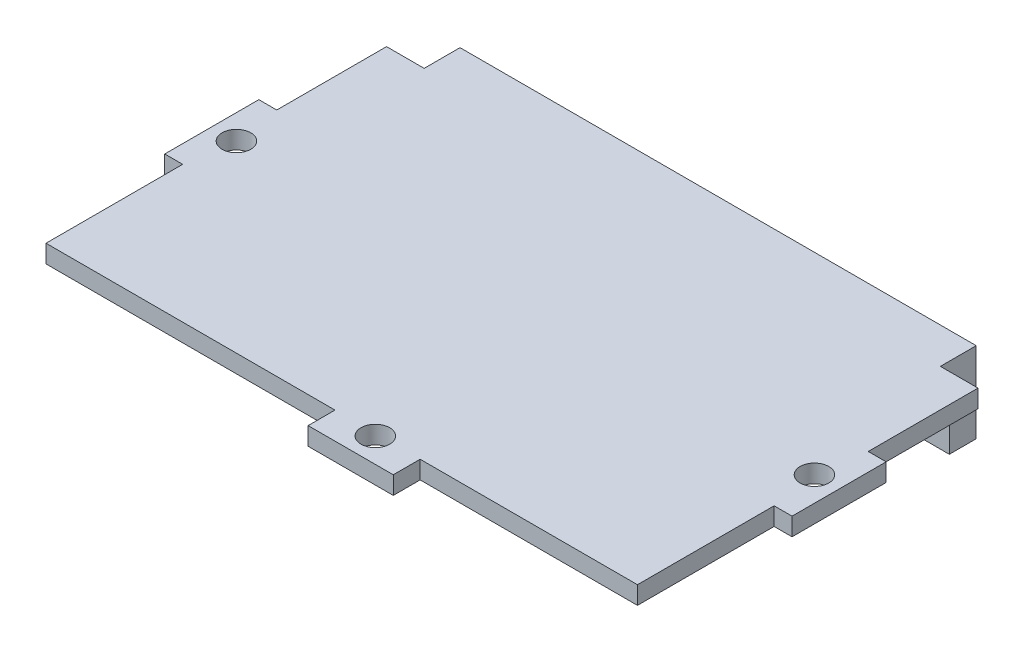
ISO-10303-21;
HEADER;
FILE_DESCRIPTION(('STEP AP214'),'2;1');
FILE_NAME('part.step','',(''),(''),'','','');
FILE_SCHEMA(('AUTOMOTIVE_DESIGN { 1 0 10303 214 1 1 1 1 }'));
ENDSEC;
DATA;
#1=APPLICATION_CONTEXT('core data for automotive mechanical design processes');
#2=APPLICATION_PROTOCOL_DEFINITION('international standard','automotive_design',2000,#1);
#3=PRODUCT_CONTEXT('',#1,'mechanical');
#4=PRODUCT('Part','Part','',(#3));
#5=PRODUCT_RELATED_PRODUCT_CATEGORY('part','',(#4));
#6=PRODUCT_DEFINITION_FORMATION('','',#4);
#7=PRODUCT_DEFINITION_CONTEXT('part definition',#1,'design');
#8=PRODUCT_DEFINITION('design','',#6,#7);
#9=PRODUCT_DEFINITION_SHAPE('','',#8);
#10=(LENGTH_UNIT() NAMED_UNIT(*) SI_UNIT(.MILLI.,.METRE.));
#11=(NAMED_UNIT(*) PLANE_ANGLE_UNIT() SI_UNIT($,.RADIAN.));
#12=(NAMED_UNIT(*) SI_UNIT($,.STERADIAN.) SOLID_ANGLE_UNIT());
#13=UNCERTAINTY_MEASURE_WITH_UNIT(LENGTH_MEASURE(1.E-05),#10,'distance_accuracy_value','');
#14=(GEOMETRIC_REPRESENTATION_CONTEXT(3) GLOBAL_UNCERTAINTY_ASSIGNED_CONTEXT((#13)) GLOBAL_UNIT_ASSIGNED_CONTEXT((#10,
#11,#12)) REPRESENTATION_CONTEXT('',''));
#15=CARTESIAN_POINT('',(0.,0.,0.));
#16=DIRECTION('',(0.,0.,1.));
#17=DIRECTION('',(1.,0.,0.));
#18=AXIS2_PLACEMENT_3D('',#15,#16,#17);
#19=CARTESIAN_POINT('',(33.,2.,21.));
#20=DIRECTION('',(0.,0.,-1.));
#21=DIRECTION('',(-1.,0.,0.));
#22=AXIS2_PLACEMENT_3D('',#19,#20,#21);
#23=PLANE('',#22);
#24=DIRECTION('',(1.,0.,0.));
#25=VECTOR('',#24,1.);
#26=CARTESIAN_POINT('',(33.,2.,21.));
#27=LINE('',#26,#25);
#28=CARTESIAN_POINT('',(8.75000000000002,2.,21.));
#29=VERTEX_POINT('',#28);
#30=CARTESIAN_POINT('',(33.,2.,21.));
#31=VERTEX_POINT('',#30);
#32=EDGE_CURVE('E343',#29,#31,#27,.T.);
#33=ORIENTED_EDGE('',*,*,#32,.F.);
#34=DIRECTION('',(0.,-1.,0.));
#35=VECTOR('',#34,1.);
#36=CARTESIAN_POINT('',(8.75000000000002,2.,21.));
#37=LINE('',#36,#35);
#38=CARTESIAN_POINT('',(8.75000000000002,0.,21.));
#39=VERTEX_POINT('',#38);
#40=EDGE_CURVE('E189',#29,#39,#37,.T.);
#41=ORIENTED_EDGE('',*,*,#40,.T.);
#42=DIRECTION('',(1.,0.,0.));
#43=VECTOR('',#42,1.);
#44=CARTESIAN_POINT('',(33.,0.,21.));
#45=LINE('',#44,#43);
#46=CARTESIAN_POINT('',(33.,0.,21.));
#47=VERTEX_POINT('',#46);
#48=EDGE_CURVE('E357',#39,#47,#45,.T.);
#49=ORIENTED_EDGE('',*,*,#48,.T.);
#50=DIRECTION('',(0.,-1.,0.));
#51=VECTOR('',#50,1.);
#52=CARTESIAN_POINT('',(33.,2.,21.));
#53=LINE('',#52,#51);
#54=EDGE_CURVE('E45',#31,#47,#53,.T.);
#55=ORIENTED_EDGE('',*,*,#54,.F.);
#56=EDGE_LOOP('',(#33,#41,#49,#55));
#57=FACE_BOUND('',#56,.T.);
#58=ADVANCED_FACE('F37',(#57),#23,.F.);
#59=CARTESIAN_POINT('',(-33.,2.,21.));
#60=DIRECTION('',(1.,0.,0.));
#61=DIRECTION('',(0.,0.,-1.));
#62=AXIS2_PLACEMENT_3D('',#59,#60,#61);
#63=PLANE('',#62);
#64=DIRECTION('',(0.,0.,1.));
#65=VECTOR('',#64,1.);
#66=CARTESIAN_POINT('',(-33.,2.,21.));
#67=LINE('',#66,#65);
#68=CARTESIAN_POINT('',(-33.,2.,5.74999999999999));
#69=VERTEX_POINT('',#68);
#70=CARTESIAN_POINT('',(-33.,2.,21.));
#71=VERTEX_POINT('',#70);
#72=EDGE_CURVE('E344',#69,#71,#67,.T.);
#73=ORIENTED_EDGE('',*,*,#72,.F.);
#74=DIRECTION('',(0.,-1.,0.));
#75=VECTOR('',#74,1.);
#76=CARTESIAN_POINT('',(-33.,2.,5.74999999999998));
#77=LINE('',#76,#75);
#78=CARTESIAN_POINT('',(-33.,0.,5.74999999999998));
#79=VERTEX_POINT('',#78);
#80=EDGE_CURVE('E274',#69,#79,#77,.T.);
#81=ORIENTED_EDGE('',*,*,#80,.T.);
#82=DIRECTION('',(0.,0.,1.));
#83=VECTOR('',#82,1.);
#84=CARTESIAN_POINT('',(-33.,0.,21.));
#85=LINE('',#84,#83);
#86=CARTESIAN_POINT('',(-33.,0.,21.));
#87=VERTEX_POINT('',#86);
#88=EDGE_CURVE('E320',#79,#87,#85,.T.);
#89=ORIENTED_EDGE('',*,*,#88,.T.);
#90=DIRECTION('',(0.,-1.,0.));
#91=VECTOR('',#90,1.);
#92=CARTESIAN_POINT('',(-33.,2.,21.));
#93=LINE('',#92,#91);
#94=EDGE_CURVE('E11',#71,#87,#93,.T.);
#95=ORIENTED_EDGE('',*,*,#94,.F.);
#96=EDGE_LOOP('',(#73,#81,#89,#95));
#97=FACE_BOUND('',#96,.T.);
#98=ADVANCED_FACE('F381',(#97),#63,.F.);
#99=CARTESIAN_POINT('',(33.,2.,21.));
#100=DIRECTION('',(-1.,0.,0.));
#101=DIRECTION('',(0.,0.,1.));
#102=AXIS2_PLACEMENT_3D('',#99,#100,#101);
#103=PLANE('',#102);
#104=DIRECTION('',(0.,0.,-1.));
#105=VECTOR('',#104,1.);
#106=CARTESIAN_POINT('',(33.,2.,21.));
#107=LINE('',#106,#105);
#108=CARTESIAN_POINT('',(33.,2.,-4.75));
#109=VERTEX_POINT('',#108);
#110=CARTESIAN_POINT('',(33.,2.,-17.));
#111=VERTEX_POINT('',#110);
#112=EDGE_CURVE('E347',#109,#111,#107,.T.);
#113=ORIENTED_EDGE('',*,*,#112,.F.);
#114=DIRECTION('',(0.,-1.,0.));
#115=VECTOR('',#114,1.);
#116=CARTESIAN_POINT('',(33.,2.,-4.75000000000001));
#117=LINE('',#116,#115);
#118=CARTESIAN_POINT('',(33.,0.,-4.75000000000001));
#119=VERTEX_POINT('',#118);
#120=EDGE_CURVE('E277',#109,#119,#117,.T.);
#121=ORIENTED_EDGE('',*,*,#120,.T.);
#122=DIRECTION('',(0.,0.,-1.));
#123=VECTOR('',#122,1.);
#124=CARTESIAN_POINT('',(33.,0.,21.));
#125=LINE('',#124,#123);
#126=CARTESIAN_POINT('',(33.,0.,-17.));
#127=VERTEX_POINT('',#126);
#128=EDGE_CURVE('E361',#119,#127,#125,.T.);
#129=ORIENTED_EDGE('',*,*,#128,.T.);
#130=DIRECTION('',(0.,1.,0.));
#131=VECTOR('',#130,1.);
#132=CARTESIAN_POINT('',(33.,0.,-17.));
#133=LINE('',#132,#131);
#134=EDGE_CURVE('E301',#127,#111,#133,.T.);
#135=ORIENTED_EDGE('',*,*,#134,.T.);
#136=EDGE_LOOP('',(#113,#121,#129,#135));
#137=FACE_BOUND('',#136,.T.);
#138=ADVANCED_FACE('F386',(#137),#103,.F.);
#139=CARTESIAN_POINT('',(-33.,0.,-17.));
#140=VERTEX_POINT('',#139);
#141=CARTESIAN_POINT('',(-33.,0.,-4.75000000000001));
#142=VERTEX_POINT('',#141);
#143=EDGE_CURVE('E354',#140,#142,#85,.T.);
#144=ORIENTED_EDGE('',*,*,#143,.T.);
#145=DIRECTION('',(0.,1.,0.));
#146=VECTOR('',#145,1.);
#147=CARTESIAN_POINT('',(-33.,2.,-4.75000000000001));
#148=LINE('',#147,#146);
#149=CARTESIAN_POINT('',(-33.,2.,-4.75000000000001));
#150=VERTEX_POINT('',#149);
#151=EDGE_CURVE('E280',#142,#150,#148,.T.);
#152=ORIENTED_EDGE('',*,*,#151,.T.);
#153=CARTESIAN_POINT('',(-33.,2.,-17.));
#154=VERTEX_POINT('',#153);
#155=EDGE_CURVE('E340',#154,#150,#67,.T.);
#156=ORIENTED_EDGE('',*,*,#155,.F.);
#157=DIRECTION('',(0.,1.,0.));
#158=VECTOR('',#157,1.);
#159=CARTESIAN_POINT('',(-33.,0.,-17.));
#160=LINE('',#159,#158);
#161=EDGE_CURVE('E311',#140,#154,#160,.T.);
#162=ORIENTED_EDGE('',*,*,#161,.F.);
#163=EDGE_LOOP('',(#144,#152,#156,#162));
#164=FACE_BOUND('',#163,.T.);
#165=ADVANCED_FACE('F39',(#164),#63,.F.);
#166=CARTESIAN_POINT('',(-0.749999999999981,0.,21.));
#167=VERTEX_POINT('',#166);
#168=EDGE_CURVE('E358',#87,#167,#45,.T.);
#169=ORIENTED_EDGE('',*,*,#168,.T.);
#170=DIRECTION('',(0.,1.,0.));
#171=VECTOR('',#170,1.);
#172=CARTESIAN_POINT('',(-0.74999999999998,2.,21.));
#173=LINE('',#172,#171);
#174=CARTESIAN_POINT('',(-0.749999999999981,2.,21.));
#175=VERTEX_POINT('',#174);
#176=EDGE_CURVE('E221',#167,#175,#173,.T.);
#177=ORIENTED_EDGE('',*,*,#176,.T.);
#178=EDGE_CURVE('E345',#71,#175,#27,.T.);
#179=ORIENTED_EDGE('',*,*,#178,.F.);
#180=ORIENTED_EDGE('',*,*,#94,.T.);
#181=EDGE_LOOP('',(#169,#177,#179,#180));
#182=FACE_BOUND('',#181,.T.);
#183=ADVANCED_FACE('F382',(#182),#23,.F.);
#184=CARTESIAN_POINT('',(33.,0.,5.75000000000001));
#185=VERTEX_POINT('',#184);
#186=EDGE_CURVE('E362',#47,#185,#125,.T.);
#187=ORIENTED_EDGE('',*,*,#186,.T.);
#188=DIRECTION('',(0.,1.,0.));
#189=VECTOR('',#188,1.);
#190=CARTESIAN_POINT('',(33.,2.,5.75000000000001));
#191=LINE('',#190,#189);
#192=CARTESIAN_POINT('',(33.,2.,5.75000000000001));
#193=VERTEX_POINT('',#192);
#194=EDGE_CURVE('E250',#185,#193,#191,.T.);
#195=ORIENTED_EDGE('',*,*,#194,.T.);
#196=EDGE_CURVE('E348',#31,#193,#107,.T.);
#197=ORIENTED_EDGE('',*,*,#196,.F.);
#198=ORIENTED_EDGE('',*,*,#54,.T.);
#199=EDGE_LOOP('',(#187,#195,#197,#198));
#200=FACE_BOUND('',#199,.T.);
#201=ADVANCED_FACE('F369',(#200),#103,.F.);
#202=CARTESIAN_POINT('',(33.,2.,-21.));
#203=DIRECTION('',(0.,0.,1.));
#204=DIRECTION('',(1.,0.,0.));
#205=AXIS2_PLACEMENT_3D('',#202,#203,#204);
#206=PLANE('',#205);
#207=DIRECTION('',(0.,1.,0.));
#208=VECTOR('',#207,1.);
#209=CARTESIAN_POINT('',(28.8,0.,-21.));
#210=LINE('',#209,#208);
#211=CARTESIAN_POINT('',(28.8,-7.,-21.));
#212=VERTEX_POINT('',#211);
#213=CARTESIAN_POINT('',(28.8,2.,-21.));
#214=VERTEX_POINT('',#213);
#215=EDGE_CURVE('E324',#212,#214,#210,.T.);
#216=ORIENTED_EDGE('',*,*,#215,.F.);
#217=DIRECTION('',(-1.,0.,0.));
#218=VECTOR('',#217,1.);
#219=CARTESIAN_POINT('',(28.8,-7.,-21.));
#220=LINE('',#219,#218);
#221=CARTESIAN_POINT('',(-28.8,-7.,-21.));
#222=VERTEX_POINT('',#221);
#223=EDGE_CURVE('E283',#212,#222,#220,.T.);
#224=ORIENTED_EDGE('',*,*,#223,.T.);
#225=DIRECTION('',(0.,1.,0.));
#226=VECTOR('',#225,1.);
#227=CARTESIAN_POINT('',(-28.8,0.,-21.));
#228=LINE('',#227,#226);
#229=CARTESIAN_POINT('',(-28.8,2.,-21.));
#230=VERTEX_POINT('',#229);
#231=EDGE_CURVE('E317',#222,#230,#228,.T.);
#232=ORIENTED_EDGE('',*,*,#231,.T.);
#233=DIRECTION('',(-1.,0.,0.));
#234=VECTOR('',#233,1.);
#235=CARTESIAN_POINT('',(33.,2.,-21.));
#236=LINE('',#235,#234);
#237=EDGE_CURVE('E351',#214,#230,#236,.T.);
#238=ORIENTED_EDGE('',*,*,#237,.F.);
#239=EDGE_LOOP('',(#216,#224,#232,#238));
#240=FACE_BOUND('',#239,.T.);
#241=ADVANCED_FACE('F395',(#240),#206,.F.);
#242=CARTESIAN_POINT('',(0.,2.,0.));
#243=DIRECTION('',(0.,1.,0.));
#244=DIRECTION('',(0.,0.,1.));
#245=AXIS2_PLACEMENT_3D('',#242,#243,#244);
#246=PLANE('',#245);
#247=CARTESIAN_POINT('',(32.25,2.,0.499999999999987));
#248=DIRECTION('',(0.,1.,0.));
#249=DIRECTION('',(0.,0.,1.));
#250=AXIS2_PLACEMENT_3D('',#247,#248,#249);
#251=CIRCLE('',#250,1.6);
#252=CARTESIAN_POINT('',(32.25,2.,2.09999999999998));
#253=VERTEX_POINT('',#252);
#254=EDGE_CURVE('E247',#253,#253,#251,.F.);
#255=ORIENTED_EDGE('',*,*,#254,.T.);
#256=EDGE_LOOP('',(#255));
#257=FACE_BOUND('',#256,.T.);
#258=CARTESIAN_POINT('',(-32.25,2.,0.499999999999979));
#259=DIRECTION('',(0.,1.,0.));
#260=DIRECTION('',(0.,0.,1.));
#261=AXIS2_PLACEMENT_3D('',#258,#259,#260);
#262=CIRCLE('',#261,1.6);
#263=CARTESIAN_POINT('',(-32.25,2.,2.09999999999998));
#264=VERTEX_POINT('',#263);
#265=EDGE_CURVE('E228',#264,#264,#262,.F.);
#266=ORIENTED_EDGE('',*,*,#265,.T.);
#267=EDGE_LOOP('',(#266));
#268=FACE_BOUND('',#267,.T.);
#269=CARTESIAN_POINT('',(4.00000000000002,2.,21.25));
#270=DIRECTION('',(0.,1.,0.));
#271=DIRECTION('',(0.,0.,1.));
#272=AXIS2_PLACEMENT_3D('',#269,#270,#271);
#273=CIRCLE('',#272,1.6);
#274=CARTESIAN_POINT('',(4.00000000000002,2.,22.85));
#275=VERTEX_POINT('',#274);
#276=EDGE_CURVE('E212',#275,#275,#273,.F.);
#277=ORIENTED_EDGE('',*,*,#276,.T.);
#278=EDGE_LOOP('',(#277));
#279=FACE_BOUND('',#278,.T.);
#280=ORIENTED_EDGE('',*,*,#178,.T.);
#281=DIRECTION('',(0.,0.,-1.));
#282=VECTOR('',#281,1.);
#283=CARTESIAN_POINT('',(-0.749999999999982,2.,24.));
#284=LINE('',#283,#282);
#285=CARTESIAN_POINT('',(-0.749999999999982,2.,24.));
#286=VERTEX_POINT('',#285);
#287=EDGE_CURVE('E197',#286,#175,#284,.T.);
#288=ORIENTED_EDGE('',*,*,#287,.F.);
#289=DIRECTION('',(-1.,0.,0.));
#290=VECTOR('',#289,1.);
#291=CARTESIAN_POINT('',(-0.749999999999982,2.,24.));
#292=LINE('',#291,#290);
#293=CARTESIAN_POINT('',(8.75000000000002,2.,24.));
#294=VERTEX_POINT('',#293);
#295=EDGE_CURVE('E194',#294,#286,#292,.T.);
#296=ORIENTED_EDGE('',*,*,#295,.F.);
#297=DIRECTION('',(0.,0.,1.));
#298=VECTOR('',#297,1.);
#299=CARTESIAN_POINT('',(8.75000000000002,2.,7.74999999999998));
#300=LINE('',#299,#298);
#301=EDGE_CURVE('E52',#29,#294,#300,.T.);
#302=ORIENTED_EDGE('',*,*,#301,.F.);
#303=ORIENTED_EDGE('',*,*,#32,.T.);
#304=ORIENTED_EDGE('',*,*,#196,.T.);
#305=DIRECTION('',(-1.,0.,0.));
#306=VECTOR('',#305,1.);
#307=CARTESIAN_POINT('',(-33.,2.,5.74999999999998));
#308=LINE('',#307,#306);
#309=CARTESIAN_POINT('',(35.,2.,5.75000000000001));
#310=VERTEX_POINT('',#309);
#311=EDGE_CURVE('E253',#310,#193,#308,.T.);
#312=ORIENTED_EDGE('',*,*,#311,.F.);
#313=DIRECTION('',(0.,0.,1.));
#314=VECTOR('',#313,1.);
#315=CARTESIAN_POINT('',(35.,2.,5.74999999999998));
#316=LINE('',#315,#314);
#317=CARTESIAN_POINT('',(35.,2.,-4.75000000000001));
#318=VERTEX_POINT('',#317);
#319=EDGE_CURVE('E224',#318,#310,#316,.T.);
#320=ORIENTED_EDGE('',*,*,#319,.F.);
#321=DIRECTION('',(1.,0.,0.));
#322=VECTOR('',#321,1.);
#323=CARTESIAN_POINT('',(35.,2.,-4.75000000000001));
#324=LINE('',#323,#322);
#325=EDGE_CURVE('E59',#109,#318,#324,.T.);
#326=ORIENTED_EDGE('',*,*,#325,.F.);
#327=ORIENTED_EDGE('',*,*,#112,.T.);
#328=DIRECTION('',(1.,0.,0.));
#329=VECTOR('',#328,1.);
#330=CARTESIAN_POINT('',(33.,2.,-17.));
#331=LINE('',#330,#329);
#332=CARTESIAN_POINT('',(28.8,2.,-17.));
#333=VERTEX_POINT('',#332);
#334=EDGE_CURVE('E331',#333,#111,#331,.T.);
#335=ORIENTED_EDGE('',*,*,#334,.F.);
#336=DIRECTION('',(0.,0.,1.));
#337=VECTOR('',#336,1.);
#338=CARTESIAN_POINT('',(28.8,2.,-21.));
#339=LINE('',#338,#337);
#340=EDGE_CURVE('E315',#214,#333,#339,.T.);
#341=ORIENTED_EDGE('',*,*,#340,.F.);
#342=ORIENTED_EDGE('',*,*,#237,.T.);
#343=DIRECTION('',(0.,0.,-1.));
#344=VECTOR('',#343,1.);
#345=CARTESIAN_POINT('',(-28.8,2.,-21.));
#346=LINE('',#345,#344);
#347=CARTESIAN_POINT('',(-28.8,2.,-17.));
#348=VERTEX_POINT('',#347);
#349=EDGE_CURVE('E308',#348,#230,#346,.T.);
#350=ORIENTED_EDGE('',*,*,#349,.F.);
#351=DIRECTION('',(1.,0.,0.));
#352=VECTOR('',#351,1.);
#353=CARTESIAN_POINT('',(-33.,2.,-17.));
#354=LINE('',#353,#352);
#355=EDGE_CURVE('E312',#154,#348,#354,.T.);
#356=ORIENTED_EDGE('',*,*,#355,.F.);
#357=ORIENTED_EDGE('',*,*,#155,.T.);
#358=CARTESIAN_POINT('',(-35.,2.,-4.75000000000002));
#359=VERTEX_POINT('',#358);
#360=EDGE_CURVE('E259',#359,#150,#324,.T.);
#361=ORIENTED_EDGE('',*,*,#360,.F.);
#362=DIRECTION('',(0.,0.,-1.));
#363=VECTOR('',#362,1.);
#364=CARTESIAN_POINT('',(-35.,2.,5.74999999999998));
#365=LINE('',#364,#363);
#366=CARTESIAN_POINT('',(-35.,2.,5.74999999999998));
#367=VERTEX_POINT('',#366);
#368=EDGE_CURVE('E262',#367,#359,#365,.T.);
#369=ORIENTED_EDGE('',*,*,#368,.F.);
#370=EDGE_CURVE('E255',#69,#367,#308,.T.);
#371=ORIENTED_EDGE('',*,*,#370,.F.);
#372=ORIENTED_EDGE('',*,*,#72,.T.);
#373=EDGE_LOOP('',(#280,#288,#296,#302,#303,#304,#312,#320,#326,#327,#335,#341,#342,#350,#356,
#357,#361,#369,#371,#372));
#374=FACE_BOUND('',#373,.T.);
#375=ADVANCED_FACE('F196',(#257,#268,#279,#374),#246,.T.);
#376=CARTESIAN_POINT('',(0.,0.,0.));
#377=DIRECTION('',(0.,1.,0.));
#378=DIRECTION('',(0.,0.,1.));
#379=AXIS2_PLACEMENT_3D('',#376,#377,#378);
#380=PLANE('',#379);
#381=ORIENTED_EDGE('',*,*,#48,.F.);
#382=DIRECTION('',(0.,0.,1.));
#383=VECTOR('',#382,1.);
#384=CARTESIAN_POINT('',(8.75000000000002,0.,7.74999999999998));
#385=LINE('',#384,#383);
#386=CARTESIAN_POINT('',(8.75000000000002,0.,24.));
#387=VERTEX_POINT('',#386);
#388=EDGE_CURVE('E217',#39,#387,#385,.T.);
#389=ORIENTED_EDGE('',*,*,#388,.T.);
#390=DIRECTION('',(-1.,0.,0.));
#391=VECTOR('',#390,1.);
#392=CARTESIAN_POINT('',(-0.749999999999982,0.,24.));
#393=LINE('',#392,#391);
#394=CARTESIAN_POINT('',(-0.749999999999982,0.,24.));
#395=VERTEX_POINT('',#394);
#396=EDGE_CURVE('E203',#387,#395,#393,.T.);
#397=ORIENTED_EDGE('',*,*,#396,.T.);
#398=DIRECTION('',(0.,0.,-1.));
#399=VECTOR('',#398,1.);
#400=CARTESIAN_POINT('',(-0.749999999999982,0.,24.));
#401=LINE('',#400,#399);
#402=EDGE_CURVE('E207',#395,#167,#401,.T.);
#403=ORIENTED_EDGE('',*,*,#402,.T.);
#404=ORIENTED_EDGE('',*,*,#168,.F.);
#405=ORIENTED_EDGE('',*,*,#88,.F.);
#406=DIRECTION('',(-1.,0.,0.));
#407=VECTOR('',#406,1.);
#408=CARTESIAN_POINT('',(-33.,0.,5.74999999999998));
#409=LINE('',#408,#407);
#410=CARTESIAN_POINT('',(-35.,0.,5.74999999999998));
#411=VERTEX_POINT('',#410);
#412=EDGE_CURVE('E236',#79,#411,#409,.T.);
#413=ORIENTED_EDGE('',*,*,#412,.T.);
#414=DIRECTION('',(0.,0.,-1.));
#415=VECTOR('',#414,1.);
#416=CARTESIAN_POINT('',(-35.,0.,5.74999999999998));
#417=LINE('',#416,#415);
#418=CARTESIAN_POINT('',(-35.,0.,-4.75000000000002));
#419=VERTEX_POINT('',#418);
#420=EDGE_CURVE('E230',#411,#419,#417,.T.);
#421=ORIENTED_EDGE('',*,*,#420,.T.);
#422=DIRECTION('',(1.,0.,0.));
#423=VECTOR('',#422,1.);
#424=CARTESIAN_POINT('',(35.,0.,-4.75000000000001));
#425=LINE('',#424,#423);
#426=EDGE_CURVE('E225',#419,#142,#425,.T.);
#427=ORIENTED_EDGE('',*,*,#426,.T.);
#428=ORIENTED_EDGE('',*,*,#143,.F.);
#429=DIRECTION('',(1.,0.,0.));
#430=VECTOR('',#429,1.);
#431=CARTESIAN_POINT('',(-33.,0.,-17.));
#432=LINE('',#431,#430);
#433=CARTESIAN_POINT('',(-28.8,0.,-17.));
#434=VERTEX_POINT('',#433);
#435=EDGE_CURVE('E304',#140,#434,#432,.T.);
#436=ORIENTED_EDGE('',*,*,#435,.T.);
#437=DIRECTION('',(0.,0.,-1.));
#438=VECTOR('',#437,1.);
#439=CARTESIAN_POINT('',(-28.8,0.,-21.));
#440=LINE('',#439,#438);
#441=CARTESIAN_POINT('',(-28.8,0.,-18.));
#442=VERTEX_POINT('',#441);
#443=EDGE_CURVE('E307',#434,#442,#440,.T.);
#444=ORIENTED_EDGE('',*,*,#443,.T.);
#445=DIRECTION('',(1.,0.,0.));
#446=VECTOR('',#445,1.);
#447=CARTESIAN_POINT('',(28.8,0.,-18.));
#448=LINE('',#447,#446);
#449=CARTESIAN_POINT('',(28.8,0.,-18.));
#450=VERTEX_POINT('',#449);
#451=EDGE_CURVE('E292',#442,#450,#448,.T.);
#452=ORIENTED_EDGE('',*,*,#451,.T.);
#453=DIRECTION('',(0.,0.,1.));
#454=VECTOR('',#453,1.);
#455=CARTESIAN_POINT('',(28.8,0.,-21.));
#456=LINE('',#455,#454);
#457=CARTESIAN_POINT('',(28.8,0.,-17.));
#458=VERTEX_POINT('',#457);
#459=EDGE_CURVE('E334',#450,#458,#456,.T.);
#460=ORIENTED_EDGE('',*,*,#459,.T.);
#461=DIRECTION('',(1.,0.,0.));
#462=VECTOR('',#461,1.);
#463=CARTESIAN_POINT('',(33.,0.,-17.));
#464=LINE('',#463,#462);
#465=EDGE_CURVE('E326',#458,#127,#464,.T.);
#466=ORIENTED_EDGE('',*,*,#465,.T.);
#467=ORIENTED_EDGE('',*,*,#128,.F.);
#468=CARTESIAN_POINT('',(35.,0.,-4.75000000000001));
#469=VERTEX_POINT('',#468);
#470=EDGE_CURVE('E229',#119,#469,#425,.T.);
#471=ORIENTED_EDGE('',*,*,#470,.T.);
#472=DIRECTION('',(0.,0.,1.));
#473=VECTOR('',#472,1.);
#474=CARTESIAN_POINT('',(35.,0.,5.74999999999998));
#475=LINE('',#474,#473);
#476=CARTESIAN_POINT('',(35.,0.,5.74999999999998));
#477=VERTEX_POINT('',#476);
#478=EDGE_CURVE('E237',#469,#477,#475,.T.);
#479=ORIENTED_EDGE('',*,*,#478,.T.);
#480=EDGE_CURVE('E233',#477,#185,#409,.T.);
#481=ORIENTED_EDGE('',*,*,#480,.T.);
#482=ORIENTED_EDGE('',*,*,#186,.F.);
#483=EDGE_LOOP('',(#381,#389,#397,#403,#404,#405,#413,#421,#427,#428,#436,#444,#452,#460,#466,
#467,#471,#479,#481,#482));
#484=FACE_BOUND('',#483,.T.);
#485=CARTESIAN_POINT('',(4.00000000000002,0.,21.25));
#486=DIRECTION('',(0.,-1.,0.));
#487=DIRECTION('',(0.,0.,-1.));
#488=AXIS2_PLACEMENT_3D('',#485,#486,#487);
#489=CIRCLE('',#488,1.6);
#490=CARTESIAN_POINT('',(4.00000000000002,0.,19.65));
#491=VERTEX_POINT('',#490);
#492=EDGE_CURVE('E204',#491,#491,#489,.T.);
#493=ORIENTED_EDGE('',*,*,#492,.F.);
#494=EDGE_LOOP('',(#493));
#495=FACE_BOUND('',#494,.T.);
#496=CARTESIAN_POINT('',(-32.25,0.,0.499999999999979));
#497=DIRECTION('',(0.,-1.,0.));
#498=DIRECTION('',(0.,0.,1.));
#499=AXIS2_PLACEMENT_3D('',#496,#497,#498);
#500=CIRCLE('',#499,1.6);
#501=CARTESIAN_POINT('',(-32.25,0.,2.09999999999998));
#502=VERTEX_POINT('',#501);
#503=EDGE_CURVE('E240',#502,#502,#500,.T.);
#504=ORIENTED_EDGE('',*,*,#503,.F.);
#505=EDGE_LOOP('',(#504));
#506=FACE_BOUND('',#505,.T.);
#507=CARTESIAN_POINT('',(32.25,0.,0.499999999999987));
#508=DIRECTION('',(0.,-1.,0.));
#509=DIRECTION('',(0.,0.,-1.));
#510=AXIS2_PLACEMENT_3D('',#507,#508,#509);
#511=CIRCLE('',#510,1.6);
#512=CARTESIAN_POINT('',(32.25,0.,-1.10000000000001));
#513=VERTEX_POINT('',#512);
#514=EDGE_CURVE('E241',#513,#513,#511,.T.);
#515=ORIENTED_EDGE('',*,*,#514,.F.);
#516=EDGE_LOOP('',(#515));
#517=FACE_BOUND('',#516,.T.);
#518=ADVANCED_FACE('F373',(#484,#495,#506,#517),#380,.F.);
#519=CARTESIAN_POINT('',(33.,0.,-17.));
#520=DIRECTION('',(0.,0.,1.));
#521=DIRECTION('',(1.,0.,0.));
#522=AXIS2_PLACEMENT_3D('',#519,#520,#521);
#523=PLANE('',#522);
#524=ORIENTED_EDGE('',*,*,#334,.T.);
#525=ORIENTED_EDGE('',*,*,#134,.F.);
#526=ORIENTED_EDGE('',*,*,#465,.F.);
#527=DIRECTION('',(0.,1.,0.));
#528=VECTOR('',#527,1.);
#529=CARTESIAN_POINT('',(28.8,0.,-17.));
#530=LINE('',#529,#528);
#531=EDGE_CURVE('E327',#458,#333,#530,.T.);
#532=ORIENTED_EDGE('',*,*,#531,.T.);
#533=EDGE_LOOP('',(#524,#525,#526,#532));
#534=FACE_BOUND('',#533,.T.);
#535=ADVANCED_FACE('F459',(#534),#523,.F.);
#536=CARTESIAN_POINT('',(28.8,0.,-21.));
#537=DIRECTION('',(-1.,0.,0.));
#538=DIRECTION('',(0.,0.,1.));
#539=AXIS2_PLACEMENT_3D('',#536,#537,#538);
#540=PLANE('',#539);
#541=ORIENTED_EDGE('',*,*,#340,.T.);
#542=ORIENTED_EDGE('',*,*,#531,.F.);
#543=ORIENTED_EDGE('',*,*,#459,.F.);
#544=DIRECTION('',(0.,-1.,0.));
#545=VECTOR('',#544,1.);
#546=CARTESIAN_POINT('',(28.8,0.,-18.));
#547=LINE('',#546,#545);
#548=CARTESIAN_POINT('',(28.8,-7.,-18.));
#549=VERTEX_POINT('',#548);
#550=EDGE_CURVE('E284',#450,#549,#547,.T.);
#551=ORIENTED_EDGE('',*,*,#550,.T.);
#552=DIRECTION('',(0.,0.,-1.));
#553=VECTOR('',#552,1.);
#554=CARTESIAN_POINT('',(28.8,-7.,-18.));
#555=LINE('',#554,#553);
#556=EDGE_CURVE('E295',#549,#212,#555,.T.);
#557=ORIENTED_EDGE('',*,*,#556,.T.);
#558=ORIENTED_EDGE('',*,*,#215,.T.);
#559=EDGE_LOOP('',(#541,#542,#543,#551,#557,#558));
#560=FACE_BOUND('',#559,.T.);
#561=ADVANCED_FACE('F452',(#560),#540,.F.);
#562=CARTESIAN_POINT('',(-28.8,0.,-21.));
#563=DIRECTION('',(1.,0.,0.));
#564=DIRECTION('',(0.,0.,-1.));
#565=AXIS2_PLACEMENT_3D('',#562,#563,#564);
#566=PLANE('',#565);
#567=ORIENTED_EDGE('',*,*,#349,.T.);
#568=ORIENTED_EDGE('',*,*,#231,.F.);
#569=DIRECTION('',(0.,0.,-1.));
#570=VECTOR('',#569,1.);
#571=CARTESIAN_POINT('',(-28.8,-7.,-18.));
#572=LINE('',#571,#570);
#573=CARTESIAN_POINT('',(-28.8,-7.,-18.));
#574=VERTEX_POINT('',#573);
#575=EDGE_CURVE('E298',#574,#222,#572,.T.);
#576=ORIENTED_EDGE('',*,*,#575,.F.);
#577=DIRECTION('',(0.,1.,0.));
#578=VECTOR('',#577,1.);
#579=CARTESIAN_POINT('',(-28.8,0.,-18.));
#580=LINE('',#579,#578);
#581=EDGE_CURVE('E290',#574,#442,#580,.T.);
#582=ORIENTED_EDGE('',*,*,#581,.T.);
#583=ORIENTED_EDGE('',*,*,#443,.F.);
#584=DIRECTION('',(0.,1.,0.));
#585=VECTOR('',#584,1.);
#586=CARTESIAN_POINT('',(-28.8,0.,-17.));
#587=LINE('',#586,#585);
#588=EDGE_CURVE('E321',#434,#348,#587,.T.);
#589=ORIENTED_EDGE('',*,*,#588,.T.);
#590=EDGE_LOOP('',(#567,#568,#576,#582,#583,#589));
#591=FACE_BOUND('',#590,.T.);
#592=ADVANCED_FACE('F449',(#591),#566,.F.);
#593=CARTESIAN_POINT('',(-33.,0.,-17.));
#594=DIRECTION('',(0.,0.,1.));
#595=DIRECTION('',(1.,0.,0.));
#596=AXIS2_PLACEMENT_3D('',#593,#594,#595);
#597=PLANE('',#596);
#598=ORIENTED_EDGE('',*,*,#355,.T.);
#599=ORIENTED_EDGE('',*,*,#588,.F.);
#600=ORIENTED_EDGE('',*,*,#435,.F.);
#601=ORIENTED_EDGE('',*,*,#161,.T.);
#602=EDGE_LOOP('',(#598,#599,#600,#601));
#603=FACE_BOUND('',#602,.T.);
#604=ADVANCED_FACE('F447',(#603),#597,.F.);
#605=CARTESIAN_POINT('',(28.8,-7.,-18.));
#606=DIRECTION('',(0.,-1.,0.));
#607=DIRECTION('',(0.,0.,-1.));
#608=AXIS2_PLACEMENT_3D('',#605,#606,#607);
#609=PLANE('',#608);
#610=ORIENTED_EDGE('',*,*,#223,.F.);
#611=ORIENTED_EDGE('',*,*,#556,.F.);
#612=DIRECTION('',(-1.,0.,0.));
#613=VECTOR('',#612,1.);
#614=CARTESIAN_POINT('',(28.8,-7.,-18.));
#615=LINE('',#614,#613);
#616=EDGE_CURVE('E287',#549,#574,#615,.T.);
#617=ORIENTED_EDGE('',*,*,#616,.T.);
#618=ORIENTED_EDGE('',*,*,#575,.T.);
#619=EDGE_LOOP('',(#610,#611,#617,#618));
#620=FACE_BOUND('',#619,.T.);
#621=ADVANCED_FACE('F443',(#620),#609,.T.);
#622=CARTESIAN_POINT('',(0.,0.,-18.));
#623=DIRECTION('',(0.,0.,-1.));
#624=DIRECTION('',(-1.,0.,0.));
#625=AXIS2_PLACEMENT_3D('',#622,#623,#624);
#626=PLANE('',#625);
#627=ORIENTED_EDGE('',*,*,#550,.F.);
#628=ORIENTED_EDGE('',*,*,#451,.F.);
#629=ORIENTED_EDGE('',*,*,#581,.F.);
#630=ORIENTED_EDGE('',*,*,#616,.F.);
#631=EDGE_LOOP('',(#627,#628,#629,#630));
#632=FACE_BOUND('',#631,.T.);
#633=ADVANCED_FACE('F433',(#632),#626,.F.);
#634=CARTESIAN_POINT('',(35.,72.7831194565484,5.74999999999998));
#635=DIRECTION('',(1.,0.,0.));
#636=DIRECTION('',(0.,0.,-1.));
#637=AXIS2_PLACEMENT_3D('',#634,#635,#636);
#638=PLANE('',#637);
#639=DIRECTION('',(0.,-1.,0.));
#640=VECTOR('',#639,1.);
#641=CARTESIAN_POINT('',(35.,72.7831194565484,-4.75000000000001));
#642=LINE('',#641,#640);
#643=EDGE_CURVE('E261',#318,#469,#642,.T.);
#644=ORIENTED_EDGE('',*,*,#643,.F.);
#645=ORIENTED_EDGE('',*,*,#319,.T.);
#646=DIRECTION('',(0.,-1.,0.));
#647=VECTOR('',#646,1.);
#648=CARTESIAN_POINT('',(35.,72.7831194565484,5.74999999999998));
#649=LINE('',#648,#647);
#650=EDGE_CURVE('E258',#310,#477,#649,.T.);
#651=ORIENTED_EDGE('',*,*,#650,.T.);
#652=ORIENTED_EDGE('',*,*,#478,.F.);
#653=EDGE_LOOP('',(#644,#645,#651,#652));
#654=FACE_BOUND('',#653,.T.);
#655=ADVANCED_FACE('F429',(#654),#638,.T.);
#656=CARTESIAN_POINT('',(32.25,72.7831194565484,0.499999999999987));
#657=DIRECTION('',(0.,-1.,0.));
#658=DIRECTION('',(0.,0.,-1.));
#659=AXIS2_PLACEMENT_3D('',#656,#657,#658);
#660=CYLINDRICAL_SURFACE('',#659,1.6);
#661=ORIENTED_EDGE('',*,*,#514,.T.);
#662=EDGE_LOOP('',(#661));
#663=FACE_BOUND('',#662,.T.);
#664=ORIENTED_EDGE('',*,*,#254,.F.);
#665=EDGE_LOOP('',(#664));
#666=FACE_BOUND('',#665,.T.);
#667=ADVANCED_FACE('F432',(#663,#666),#660,.F.);
#668=CARTESIAN_POINT('',(-33.,72.7831194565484,5.74999999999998));
#669=DIRECTION('',(0.,0.,1.));
#670=DIRECTION('',(1.,0.,0.));
#671=AXIS2_PLACEMENT_3D('',#668,#669,#670);
#672=PLANE('',#671);
#673=ORIENTED_EDGE('',*,*,#194,.F.);
#674=ORIENTED_EDGE('',*,*,#480,.F.);
#675=ORIENTED_EDGE('',*,*,#650,.F.);
#676=ORIENTED_EDGE('',*,*,#311,.T.);
#677=EDGE_LOOP('',(#673,#674,#675,#676));
#678=FACE_BOUND('',#677,.T.);
#679=ADVANCED_FACE('F379',(#678),#672,.T.);
#680=CARTESIAN_POINT('',(35.,72.7831194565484,-4.75000000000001));
#681=DIRECTION('',(0.,0.,-1.));
#682=DIRECTION('',(-1.,0.,0.));
#683=AXIS2_PLACEMENT_3D('',#680,#681,#682);
#684=PLANE('',#683);
#685=ORIENTED_EDGE('',*,*,#120,.F.);
#686=ORIENTED_EDGE('',*,*,#325,.T.);
#687=ORIENTED_EDGE('',*,*,#643,.T.);
#688=ORIENTED_EDGE('',*,*,#470,.F.);
#689=EDGE_LOOP('',(#685,#686,#687,#688));
#690=FACE_BOUND('',#689,.T.);
#691=ADVANCED_FACE('F427',(#690),#684,.T.);
#692=ORIENTED_EDGE('',*,*,#151,.F.);
#693=ORIENTED_EDGE('',*,*,#426,.F.);
#694=DIRECTION('',(0.,-1.,0.));
#695=VECTOR('',#694,1.);
#696=CARTESIAN_POINT('',(-35.,72.7831194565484,-4.75000000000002));
#697=LINE('',#696,#695);
#698=EDGE_CURVE('E265',#359,#419,#697,.T.);
#699=ORIENTED_EDGE('',*,*,#698,.F.);
#700=ORIENTED_EDGE('',*,*,#360,.T.);
#701=EDGE_LOOP('',(#692,#693,#699,#700));
#702=FACE_BOUND('',#701,.T.);
#703=ADVANCED_FACE('F422',(#702),#684,.T.);
#704=ORIENTED_EDGE('',*,*,#80,.F.);
#705=ORIENTED_EDGE('',*,*,#370,.T.);
#706=DIRECTION('',(0.,-1.,0.));
#707=VECTOR('',#706,1.);
#708=CARTESIAN_POINT('',(-35.,72.7831194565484,5.74999999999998));
#709=LINE('',#708,#707);
#710=EDGE_CURVE('E244',#367,#411,#709,.T.);
#711=ORIENTED_EDGE('',*,*,#710,.T.);
#712=ORIENTED_EDGE('',*,*,#412,.F.);
#713=EDGE_LOOP('',(#704,#705,#711,#712));
#714=FACE_BOUND('',#713,.T.);
#715=ADVANCED_FACE('F420',(#714),#672,.T.);
#716=CARTESIAN_POINT('',(-32.25,72.7831194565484,0.499999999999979));
#717=DIRECTION('',(0.,-1.,0.));
#718=DIRECTION('',(0.,0.,-1.));
#719=AXIS2_PLACEMENT_3D('',#716,#717,#718);
#720=CYLINDRICAL_SURFACE('',#719,1.6);
#721=ORIENTED_EDGE('',*,*,#503,.T.);
#722=EDGE_LOOP('',(#721));
#723=FACE_BOUND('',#722,.T.);
#724=ORIENTED_EDGE('',*,*,#265,.F.);
#725=EDGE_LOOP('',(#724));
#726=FACE_BOUND('',#725,.T.);
#727=ADVANCED_FACE('F413',(#723,#726),#720,.F.);
#728=CARTESIAN_POINT('',(-35.,72.7831194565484,5.74999999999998));
#729=DIRECTION('',(-1.,0.,0.));
#730=DIRECTION('',(0.,0.,1.));
#731=AXIS2_PLACEMENT_3D('',#728,#729,#730);
#732=PLANE('',#731);
#733=ORIENTED_EDGE('',*,*,#710,.F.);
#734=ORIENTED_EDGE('',*,*,#368,.T.);
#735=ORIENTED_EDGE('',*,*,#698,.T.);
#736=ORIENTED_EDGE('',*,*,#420,.F.);
#737=EDGE_LOOP('',(#733,#734,#735,#736));
#738=FACE_BOUND('',#737,.T.);
#739=ADVANCED_FACE('F405',(#738),#732,.T.);
#740=CARTESIAN_POINT('',(-0.749999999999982,72.7831194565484,24.));
#741=DIRECTION('',(-1.,0.,0.));
#742=DIRECTION('',(0.,0.,1.));
#743=AXIS2_PLACEMENT_3D('',#740,#741,#742);
#744=PLANE('',#743);
#745=ORIENTED_EDGE('',*,*,#176,.F.);
#746=ORIENTED_EDGE('',*,*,#402,.F.);
#747=DIRECTION('',(0.,-1.,0.));
#748=VECTOR('',#747,1.);
#749=CARTESIAN_POINT('',(-0.749999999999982,72.7831194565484,24.));
#750=LINE('',#749,#748);
#751=EDGE_CURVE('E191',#286,#395,#750,.T.);
#752=ORIENTED_EDGE('',*,*,#751,.F.);
#753=ORIENTED_EDGE('',*,*,#287,.T.);
#754=EDGE_LOOP('',(#745,#746,#752,#753));
#755=FACE_BOUND('',#754,.T.);
#756=ADVANCED_FACE('F403',(#755),#744,.T.);
#757=CARTESIAN_POINT('',(8.75000000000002,72.7831194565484,7.74999999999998));
#758=DIRECTION('',(1.,0.,0.));
#759=DIRECTION('',(0.,0.,-1.));
#760=AXIS2_PLACEMENT_3D('',#757,#758,#759);
#761=PLANE('',#760);
#762=ORIENTED_EDGE('',*,*,#40,.F.);
#763=ORIENTED_EDGE('',*,*,#301,.T.);
#764=DIRECTION('',(0.,-1.,0.));
#765=VECTOR('',#764,1.);
#766=CARTESIAN_POINT('',(8.75000000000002,72.7831194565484,24.));
#767=LINE('',#766,#765);
#768=EDGE_CURVE('E186',#294,#387,#767,.T.);
#769=ORIENTED_EDGE('',*,*,#768,.T.);
#770=ORIENTED_EDGE('',*,*,#388,.F.);
#771=EDGE_LOOP('',(#762,#763,#769,#770));
#772=FACE_BOUND('',#771,.T.);
#773=ADVANCED_FACE('F184',(#772),#761,.T.);
#774=CARTESIAN_POINT('',(4.00000000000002,72.7831194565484,21.25));
#775=DIRECTION('',(0.,-1.,0.));
#776=DIRECTION('',(0.,0.,-1.));
#777=AXIS2_PLACEMENT_3D('',#774,#775,#776);
#778=CYLINDRICAL_SURFACE('',#777,1.6);
#779=ORIENTED_EDGE('',*,*,#492,.T.);
#780=EDGE_LOOP('',(#779));
#781=FACE_BOUND('',#780,.T.);
#782=ORIENTED_EDGE('',*,*,#276,.F.);
#783=EDGE_LOOP('',(#782));
#784=FACE_BOUND('',#783,.T.);
#785=ADVANCED_FACE('F411',(#781,#784),#778,.F.);
#786=CARTESIAN_POINT('',(-0.749999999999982,72.7831194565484,24.));
#787=DIRECTION('',(0.,0.,1.));
#788=DIRECTION('',(1.,0.,0.));
#789=AXIS2_PLACEMENT_3D('',#786,#787,#788);
#790=PLANE('',#789);
#791=ORIENTED_EDGE('',*,*,#768,.F.);
#792=ORIENTED_EDGE('',*,*,#295,.T.);
#793=ORIENTED_EDGE('',*,*,#751,.T.);
#794=ORIENTED_EDGE('',*,*,#396,.F.);
#795=EDGE_LOOP('',(#791,#792,#793,#794));
#796=FACE_BOUND('',#795,.T.);
#797=ADVANCED_FACE('F201',(#796),#790,.T.);
#798=CLOSED_SHELL('',(#58,#98,#138,#165,#183,#201,#241,#375,#518,#535,#561,#592,#604,#621,#633,
#655,#667,#679,#691,#703,#715,#727,#739,#756,#773,#785,#797));
#799=MANIFOLD_SOLID_BREP('B2',#798);
#800=ADVANCED_BREP_SHAPE_REPRESENTATION('',(#18,#799),#14);
#801=SHAPE_DEFINITION_REPRESENTATION(#9,#800);
ENDSEC;
END-ISO-10303-21;
